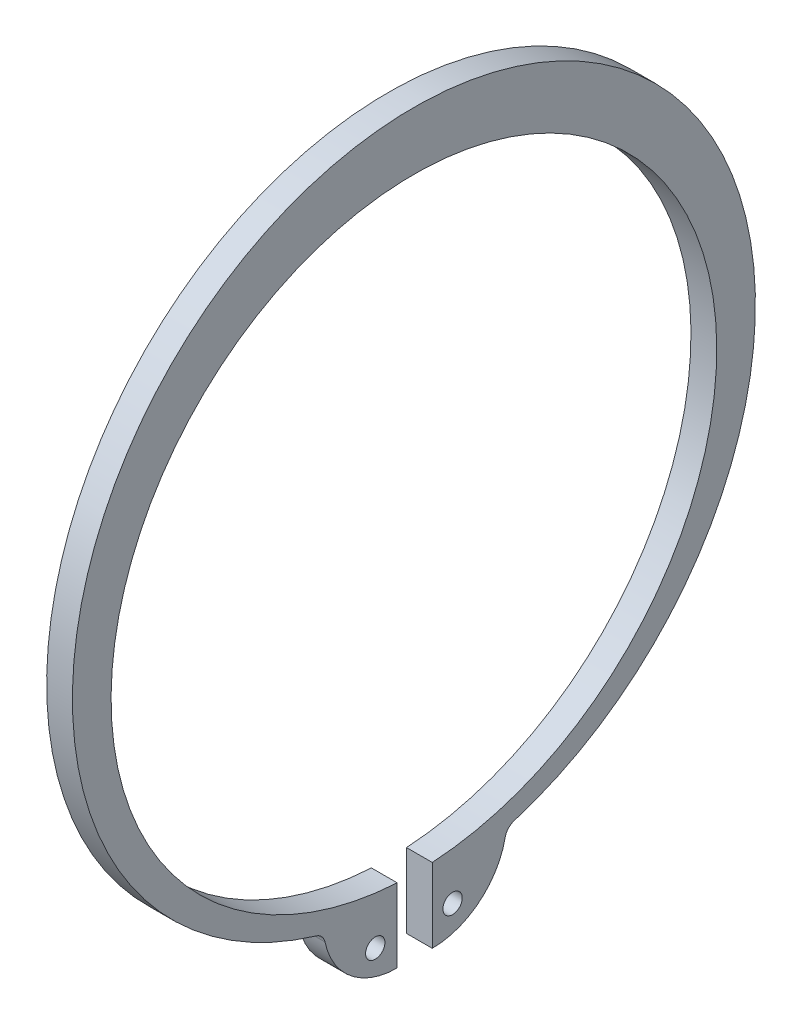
from build123d import *

# Parameters (mm, degrees)
ESQUISSE1_R          = 0.75
BASE_EXTRUSION_DEPTH = 2


with BuildPart() as part:
    # Esquisse1 → Base-Extrusion (new body)
    with BuildSketch(Plane(origin=(0, 0, 0), x_dir=(0, 0, -1), z_dir=(1, 0, 0))):
        with BuildLine():
            Line((-1.297960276, -23.464127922), (-1.297960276, -29.18914006))
            ThreePointArc((-1.297960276, -29.18914006), (-4.905990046, -27.909112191), (-6.900615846, -24.641419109))
            ThreePointArc((-6.900615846, -24.641419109), (-7.14324902, -24.170071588), (-7.592725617, -23.88898418))
            ThreePointArc((-7.592725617, -23.88898418), (-0.093728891, 27.999834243), (7.772133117, -23.834639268))
            ThreePointArc((7.772133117, -23.834639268), (7.324040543, -24.11957861), (7.085000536, -24.593748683))
            ThreePointArc((7.085000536, -24.593748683), (5.082952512, -27.923418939), (1.424242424, -29.230607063))
            Line((1.424242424, -29.230607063), (1.424242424, -23.456801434))
            ThreePointArc((1.424242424, -23.456801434), (-0.06324725, 23.499914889), (-1.297960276, -23.464127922))
        make_face()
        with Locations((-3, -27)):
            Circle(ESQUISSE1_R, mode=Mode.SUBTRACT)
        with Locations((3, -27)):
            Circle(ESQUISSE1_R, mode=Mode.SUBTRACT)
    extrude(amount=BASE_EXTRUSION_DEPTH)


solid = part.part
